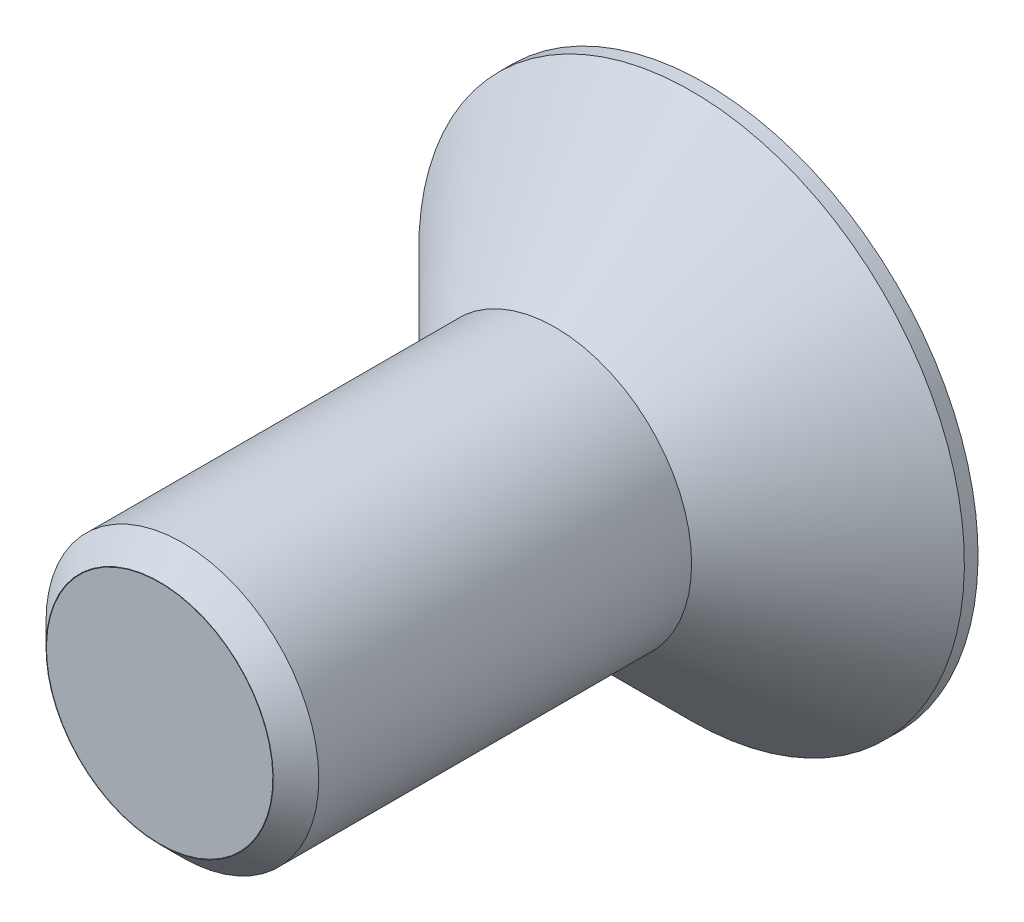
ISO-10303-21;
HEADER;
FILE_DESCRIPTION(('STEP AP214'),'2;1');
FILE_NAME('part.step','',(''),(''),'','','');
FILE_SCHEMA(('AUTOMOTIVE_DESIGN { 1 0 10303 214 1 1 1 1 }'));
ENDSEC;
DATA;
#1=APPLICATION_CONTEXT('core data for automotive mechanical design processes');
#2=APPLICATION_PROTOCOL_DEFINITION('international standard','automotive_design',2000,#1);
#3=PRODUCT_CONTEXT('',#1,'mechanical');
#4=PRODUCT('Part','Part','',(#3));
#5=PRODUCT_RELATED_PRODUCT_CATEGORY('part','',(#4));
#6=PRODUCT_DEFINITION_FORMATION('','',#4);
#7=PRODUCT_DEFINITION_CONTEXT('part definition',#1,'design');
#8=PRODUCT_DEFINITION('design','',#6,#7);
#9=PRODUCT_DEFINITION_SHAPE('','',#8);
#10=(LENGTH_UNIT() NAMED_UNIT(*) SI_UNIT(.MILLI.,.METRE.));
#11=(NAMED_UNIT(*) PLANE_ANGLE_UNIT() SI_UNIT($,.RADIAN.));
#12=(NAMED_UNIT(*) SI_UNIT($,.STERADIAN.) SOLID_ANGLE_UNIT());
#13=UNCERTAINTY_MEASURE_WITH_UNIT(LENGTH_MEASURE(1.E-05),#10,'distance_accuracy_value','');
#14=(GEOMETRIC_REPRESENTATION_CONTEXT(3) GLOBAL_UNCERTAINTY_ASSIGNED_CONTEXT((#13)) GLOBAL_UNIT_ASSIGNED_CONTEXT((#10,
#11,#12)) REPRESENTATION_CONTEXT('',''));
#15=CARTESIAN_POINT('',(0.,0.,0.));
#16=DIRECTION('',(0.,0.,1.));
#17=DIRECTION('',(1.,0.,0.));
#18=AXIS2_PLACEMENT_3D('',#15,#16,#17);
#19=CARTESIAN_POINT('',(0.,0.,0.));
#20=DIRECTION('',(0.,0.,-1.));
#21=DIRECTION('',(0.,1.,0.));
#22=AXIS2_PLACEMENT_3D('',#19,#20,#21);
#23=PLANE('',#22);
#24=DIRECTION('',(-1.,0.,0.));
#25=VECTOR('',#24,1.);
#26=CARTESIAN_POINT('',(1.15470053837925,-1.9999999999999,0.));
#27=LINE('',#26,#25);
#28=CARTESIAN_POINT('',(1.15470053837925,-1.9999999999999,0.));
#29=VERTEX_POINT('',#28);
#30=CARTESIAN_POINT('',(-1.15470053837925,-1.9999999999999,0.));
#31=VERTEX_POINT('',#30);
#32=EDGE_CURVE('E48',#29,#31,#27,.T.);
#33=ORIENTED_EDGE('',*,*,#32,.F.);
#34=DIRECTION('',(-0.5,-0.866025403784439,0.));
#35=VECTOR('',#34,1.);
#36=CARTESIAN_POINT('',(2.30940107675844,0.,0.));
#37=LINE('',#36,#35);
#38=CARTESIAN_POINT('',(2.30940107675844,0.,0.));
#39=VERTEX_POINT('',#38);
#40=EDGE_CURVE('E131',#39,#29,#37,.T.);
#41=ORIENTED_EDGE('',*,*,#40,.F.);
#42=DIRECTION('',(0.5,-0.866025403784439,0.));
#43=VECTOR('',#42,1.);
#44=CARTESIAN_POINT('',(1.15470053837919,2.,0.));
#45=LINE('',#44,#43);
#46=CARTESIAN_POINT('',(1.15470053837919,2.,0.));
#47=VERTEX_POINT('',#46);
#48=EDGE_CURVE('E129',#47,#39,#45,.T.);
#49=ORIENTED_EDGE('',*,*,#48,.F.);
#50=DIRECTION('',(1.,0.,0.));
#51=VECTOR('',#50,1.);
#52=CARTESIAN_POINT('',(-1.15470053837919,2.,0.));
#53=LINE('',#52,#51);
#54=CARTESIAN_POINT('',(-1.15470053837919,2.,0.));
#55=VERTEX_POINT('',#54);
#56=EDGE_CURVE('E96',#55,#47,#53,.T.);
#57=ORIENTED_EDGE('',*,*,#56,.F.);
#58=DIRECTION('',(0.5,0.866025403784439,0.));
#59=VECTOR('',#58,1.);
#60=CARTESIAN_POINT('',(-2.30940107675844,0.,0.));
#61=LINE('',#60,#59);
#62=CARTESIAN_POINT('',(-2.30940107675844,0.,0.));
#63=VERTEX_POINT('',#62);
#64=EDGE_CURVE('E125',#63,#55,#61,.T.);
#65=ORIENTED_EDGE('',*,*,#64,.F.);
#66=DIRECTION('',(-0.5,0.866025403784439,0.));
#67=VECTOR('',#66,1.);
#68=CARTESIAN_POINT('',(-1.15470053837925,-1.9999999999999,0.));
#69=LINE('',#68,#67);
#70=EDGE_CURVE('E122',#31,#63,#69,.T.);
#71=ORIENTED_EDGE('',*,*,#70,.F.);
#72=EDGE_LOOP('',(#33,#41,#49,#57,#65,#71));
#73=FACE_BOUND('',#72,.T.);
#74=CARTESIAN_POINT('',(0.,0.,0.));
#75=DIRECTION('',(0.,0.,1.));
#76=DIRECTION('',(0.,-1.,0.));
#77=AXIS2_PLACEMENT_3D('',#74,#75,#76);
#78=CIRCLE('',#77,6.);
#79=CARTESIAN_POINT('',(0.,-6.,0.));
#80=VERTEX_POINT('',#79);
#81=EDGE_CURVE('E11',#80,#80,#78,.T.);
#82=ORIENTED_EDGE('',*,*,#81,.F.);
#83=EDGE_LOOP('',(#82));
#84=FACE_BOUND('',#83,.T.);
#85=ADVANCED_FACE('F34',(#73,#84),#23,.T.);
#86=CARTESIAN_POINT('',(0.,0.,0.));
#87=DIRECTION('',(0.,0.,1.));
#88=DIRECTION('',(0.,-1.,0.));
#89=AXIS2_PLACEMENT_3D('',#86,#87,#88);
#90=CYLINDRICAL_SURFACE('',#89,5.99999999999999);
#91=ORIENTED_EDGE('',*,*,#81,.T.);
#92=EDGE_LOOP('',(#91));
#93=FACE_BOUND('',#92,.T.);
#94=CARTESIAN_POINT('',(0.,0.,0.300000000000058));
#95=DIRECTION('',(0.,0.,1.));
#96=DIRECTION('',(0.,-1.,0.));
#97=AXIS2_PLACEMENT_3D('',#94,#95,#96);
#98=CIRCLE('',#97,5.99999999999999);
#99=CARTESIAN_POINT('',(0.,-5.99999999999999,0.300000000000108));
#100=VERTEX_POINT('',#99);
#101=EDGE_CURVE('E41',#100,#100,#98,.T.);
#102=ORIENTED_EDGE('',*,*,#101,.F.);
#103=EDGE_LOOP('',(#102));
#104=FACE_BOUND('',#103,.T.);
#105=ADVANCED_FACE('F169',(#93,#104),#90,.T.);
#106=CARTESIAN_POINT('',(0.,0.,3.30000000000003));
#107=DIRECTION('',(0.,0.,-1.));
#108=DIRECTION('',(0.,1.,0.));
#109=AXIS2_PLACEMENT_3D('',#106,#107,#108);
#110=CONICAL_SURFACE('',#109,2.99999999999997,0.785398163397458);
#111=ORIENTED_EDGE('',*,*,#101,.T.);
#112=EDGE_LOOP('',(#111));
#113=FACE_BOUND('',#112,.T.);
#114=CARTESIAN_POINT('',(0.,0.,3.30000000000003));
#115=DIRECTION('',(0.,0.,1.));
#116=DIRECTION('',(0.,-1.,0.));
#117=AXIS2_PLACEMENT_3D('',#114,#115,#116);
#118=CIRCLE('',#117,2.99999999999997);
#119=CARTESIAN_POINT('',(0.,-2.99999999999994,3.30000000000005));
#120=VERTEX_POINT('',#119);
#121=EDGE_CURVE('E161',#120,#120,#118,.T.);
#122=ORIENTED_EDGE('',*,*,#121,.F.);
#123=EDGE_LOOP('',(#122));
#124=FACE_BOUND('',#123,.T.);
#125=ADVANCED_FACE('F166',(#113,#124),#110,.T.);
#126=CARTESIAN_POINT('',(0.,0.,0.));
#127=DIRECTION('',(0.,0.,1.));
#128=DIRECTION('',(0.,-1.,0.));
#129=AXIS2_PLACEMENT_3D('',#126,#127,#128);
#130=CYLINDRICAL_SURFACE('',#129,2.99999999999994);
#131=ORIENTED_EDGE('',*,*,#121,.T.);
#132=EDGE_LOOP('',(#131));
#133=FACE_BOUND('',#132,.T.);
#134=CARTESIAN_POINT('',(0.,0.,11.5));
#135=DIRECTION('',(0.,0.,1.));
#136=DIRECTION('',(0.,-1.,0.));
#137=AXIS2_PLACEMENT_3D('',#134,#135,#136);
#138=CIRCLE('',#137,2.9999999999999);
#139=CARTESIAN_POINT('',(0.,-2.9999999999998,11.5000000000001));
#140=VERTEX_POINT('',#139);
#141=EDGE_CURVE('E158',#140,#140,#138,.T.);
#142=ORIENTED_EDGE('',*,*,#141,.F.);
#143=EDGE_LOOP('',(#142));
#144=FACE_BOUND('',#143,.T.);
#145=ADVANCED_FACE('F176',(#133,#144),#130,.T.);
#146=CARTESIAN_POINT('',(0.,0.,12.));
#147=DIRECTION('',(0.,0.,-1.));
#148=DIRECTION('',(0.,1.,0.));
#149=AXIS2_PLACEMENT_3D('',#146,#147,#148);
#150=CONICAL_SURFACE('',#149,2.4999999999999,0.785398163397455);
#151=ORIENTED_EDGE('',*,*,#141,.T.);
#152=EDGE_LOOP('',(#151));
#153=FACE_BOUND('',#152,.T.);
#154=CARTESIAN_POINT('',(0.,0.,12.));
#155=DIRECTION('',(0.,0.,1.));
#156=DIRECTION('',(0.,-1.,0.));
#157=AXIS2_PLACEMENT_3D('',#154,#155,#156);
#158=CIRCLE('',#157,2.4999999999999);
#159=CARTESIAN_POINT('',(0.,-2.4999999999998,12.));
#160=VERTEX_POINT('',#159);
#161=EDGE_CURVE('E155',#160,#160,#158,.T.);
#162=ORIENTED_EDGE('',*,*,#161,.F.);
#163=EDGE_LOOP('',(#162));
#164=FACE_BOUND('',#163,.T.);
#165=ADVANCED_FACE('F182',(#153,#164),#150,.T.);
#166=CARTESIAN_POINT('',(0.,0.,0.));
#167=DIRECTION('',(0.,0.,1.));
#168=DIRECTION('',(0.,-1.,0.));
#169=AXIS2_PLACEMENT_3D('',#166,#167,#168);
#170=CYLINDRICAL_SURFACE('',#169,2.49999999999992);
#171=ORIENTED_EDGE('',*,*,#161,.T.);
#172=EDGE_LOOP('',(#171));
#173=FACE_BOUND('',#172,.T.);
#174=CARTESIAN_POINT('',(0.,0.,6.49000000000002));
#175=DIRECTION('',(0.,0.,1.));
#176=DIRECTION('',(0.,-1.,0.));
#177=AXIS2_PLACEMENT_3D('',#174,#175,#176);
#178=CIRCLE('',#177,2.49999999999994);
#179=CARTESIAN_POINT('',(0.,-2.49999999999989,6.49000000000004));
#180=VERTEX_POINT('',#179);
#181=EDGE_CURVE('E152',#180,#180,#178,.T.);
#182=ORIENTED_EDGE('',*,*,#181,.F.);
#183=EDGE_LOOP('',(#182));
#184=FACE_BOUND('',#183,.T.);
#185=ADVANCED_FACE('F186',(#173,#184),#170,.F.);
#186=CARTESIAN_POINT('',(0.,0.,6.00000000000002));
#187=DIRECTION('',(0.,0.,-1.));
#188=DIRECTION('',(0.,1.,0.));
#189=AXIS2_PLACEMENT_3D('',#186,#187,#188);
#190=CONICAL_SURFACE('',#189,2.98999999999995,0.785398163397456);
#191=ORIENTED_EDGE('',*,*,#181,.T.);
#192=EDGE_LOOP('',(#191));
#193=FACE_BOUND('',#192,.T.);
#194=CARTESIAN_POINT('',(0.,0.,6.00000000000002));
#195=DIRECTION('',(0.,0.,1.));
#196=DIRECTION('',(0.,-1.,0.));
#197=AXIS2_PLACEMENT_3D('',#194,#195,#196);
#198=CIRCLE('',#197,2.98999999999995);
#199=CARTESIAN_POINT('',(0.,-2.9899999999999,6.00000000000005));
#200=VERTEX_POINT('',#199);
#201=EDGE_CURVE('E149',#200,#200,#198,.T.);
#202=ORIENTED_EDGE('',*,*,#201,.F.);
#203=EDGE_LOOP('',(#202));
#204=FACE_BOUND('',#203,.T.);
#205=ADVANCED_FACE('F190',(#193,#204),#190,.F.);
#206=CARTESIAN_POINT('',(0.,0.,0.));
#207=DIRECTION('',(0.,0.,1.));
#208=DIRECTION('',(0.,-1.,0.));
#209=AXIS2_PLACEMENT_3D('',#206,#207,#208);
#210=CYLINDRICAL_SURFACE('',#209,2.98999999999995);
#211=ORIENTED_EDGE('',*,*,#201,.T.);
#212=EDGE_LOOP('',(#211));
#213=FACE_BOUND('',#212,.T.);
#214=CARTESIAN_POINT('',(0.,0.,5.99000000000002));
#215=DIRECTION('',(0.,0.,1.));
#216=DIRECTION('',(0.,-1.,0.));
#217=AXIS2_PLACEMENT_3D('',#214,#215,#216);
#218=CIRCLE('',#217,2.98999999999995);
#219=CARTESIAN_POINT('',(0.,-2.9899999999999,5.99000000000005));
#220=VERTEX_POINT('',#219);
#221=EDGE_CURVE('E146',#220,#220,#218,.T.);
#222=ORIENTED_EDGE('',*,*,#221,.F.);
#223=EDGE_LOOP('',(#222));
#224=FACE_BOUND('',#223,.T.);
#225=ADVANCED_FACE('F194',(#213,#224),#210,.F.);
#226=CARTESIAN_POINT('',(0.,0.,6.49000000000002));
#227=DIRECTION('',(0.,0.,-1.));
#228=DIRECTION('',(0.,1.,0.));
#229=AXIS2_PLACEMENT_3D('',#226,#227,#228);
#230=CONICAL_SURFACE('',#229,2.48999999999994,0.785398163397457);
#231=ORIENTED_EDGE('',*,*,#221,.T.);
#232=EDGE_LOOP('',(#231));
#233=FACE_BOUND('',#232,.T.);
#234=CARTESIAN_POINT('',(0.,0.,6.49000000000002));
#235=DIRECTION('',(0.,0.,1.));
#236=DIRECTION('',(0.,-1.,0.));
#237=AXIS2_PLACEMENT_3D('',#234,#235,#236);
#238=CIRCLE('',#237,2.48999999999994);
#239=CARTESIAN_POINT('',(0.,-2.48999999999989,6.49000000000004));
#240=VERTEX_POINT('',#239);
#241=EDGE_CURVE('E143',#240,#240,#238,.T.);
#242=ORIENTED_EDGE('',*,*,#241,.F.);
#243=EDGE_LOOP('',(#242));
#244=FACE_BOUND('',#243,.T.);
#245=ADVANCED_FACE('F198',(#233,#244),#230,.T.);
#246=CARTESIAN_POINT('',(0.,0.,0.));
#247=DIRECTION('',(0.,0.,1.));
#248=DIRECTION('',(0.,-1.,0.));
#249=AXIS2_PLACEMENT_3D('',#246,#247,#248);
#250=CYLINDRICAL_SURFACE('',#249,2.48999999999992);
#251=ORIENTED_EDGE('',*,*,#241,.T.);
#252=EDGE_LOOP('',(#251));
#253=FACE_BOUND('',#252,.T.);
#254=CARTESIAN_POINT('',(0.,0.,12.));
#255=DIRECTION('',(0.,0.,1.));
#256=DIRECTION('',(0.,-1.,0.));
#257=AXIS2_PLACEMENT_3D('',#254,#255,#256);
#258=CIRCLE('',#257,2.4899999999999);
#259=CARTESIAN_POINT('',(0.,-2.4899999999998,12.));
#260=VERTEX_POINT('',#259);
#261=EDGE_CURVE('E135',#260,#260,#258,.T.);
#262=ORIENTED_EDGE('',*,*,#261,.F.);
#263=EDGE_LOOP('',(#262));
#264=FACE_BOUND('',#263,.T.);
#265=ADVANCED_FACE('F202',(#253,#264),#250,.T.);
#266=CARTESIAN_POINT('',(0.,2.49,12.));
#267=DIRECTION('',(0.,0.,1.));
#268=DIRECTION('',(0.,-1.,0.));
#269=AXIS2_PLACEMENT_3D('',#266,#267,#268);
#270=PLANE('',#269);
#271=ORIENTED_EDGE('',*,*,#261,.T.);
#272=EDGE_LOOP('',(#271));
#273=FACE_BOUND('',#272,.T.);
#274=ADVANCED_FACE('F206',(#273),#270,.T.);
#275=CARTESIAN_POINT('',(1.15470053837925,-1.9999999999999,2.5));
#276=DIRECTION('',(0.,-1.,0.));
#277=DIRECTION('',(0.,0.,-1.));
#278=AXIS2_PLACEMENT_3D('',#275,#276,#277);
#279=PLANE('',#278);
#280=ORIENTED_EDGE('',*,*,#32,.T.);
#281=DIRECTION('',(0.,0.,-1.));
#282=VECTOR('',#281,1.);
#283=CARTESIAN_POINT('',(-1.15470053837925,-1.9999999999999,2.5));
#284=LINE('',#283,#282);
#285=CARTESIAN_POINT('',(-1.15470053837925,-1.9999999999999,2.5));
#286=VERTEX_POINT('',#285);
#287=EDGE_CURVE('E78',#286,#31,#284,.T.);
#288=ORIENTED_EDGE('',*,*,#287,.F.);
#289=DIRECTION('',(-1.,0.,0.));
#290=VECTOR('',#289,1.);
#291=CARTESIAN_POINT('',(1.15470053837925,-1.9999999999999,2.5));
#292=LINE('',#291,#290);
#293=CARTESIAN_POINT('',(1.15470053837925,-1.9999999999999,2.5));
#294=VERTEX_POINT('',#293);
#295=EDGE_CURVE('E133',#294,#286,#292,.T.);
#296=ORIENTED_EDGE('',*,*,#295,.F.);
#297=DIRECTION('',(0.,0.,-1.));
#298=VECTOR('',#297,1.);
#299=CARTESIAN_POINT('',(1.15470053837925,-1.9999999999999,2.5));
#300=LINE('',#299,#298);
#301=EDGE_CURVE('E56',#294,#29,#300,.T.);
#302=ORIENTED_EDGE('',*,*,#301,.T.);
#303=EDGE_LOOP('',(#280,#288,#296,#302));
#304=FACE_BOUND('',#303,.T.);
#305=ADVANCED_FACE('F210',(#304),#279,.F.);
#306=CARTESIAN_POINT('',(2.30940107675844,0.,2.5));
#307=DIRECTION('',(0.866025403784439,-0.499999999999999,0.));
#308=DIRECTION('',(0.5,0.866025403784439,0.));
#309=AXIS2_PLACEMENT_3D('',#306,#307,#308);
#310=PLANE('',#309);
#311=ORIENTED_EDGE('',*,*,#40,.T.);
#312=ORIENTED_EDGE('',*,*,#301,.F.);
#313=DIRECTION('',(-0.5,-0.866025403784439,0.));
#314=VECTOR('',#313,1.);
#315=CARTESIAN_POINT('',(2.30940107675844,0.,2.5));
#316=LINE('',#315,#314);
#317=CARTESIAN_POINT('',(2.30940107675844,0.,2.5));
#318=VERTEX_POINT('',#317);
#319=EDGE_CURVE('E108',#318,#294,#316,.T.);
#320=ORIENTED_EDGE('',*,*,#319,.F.);
#321=DIRECTION('',(0.,0.,-1.));
#322=VECTOR('',#321,1.);
#323=CARTESIAN_POINT('',(2.30940107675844,0.,2.5));
#324=LINE('',#323,#322);
#325=EDGE_CURVE('E100',#318,#39,#324,.T.);
#326=ORIENTED_EDGE('',*,*,#325,.T.);
#327=EDGE_LOOP('',(#311,#312,#320,#326));
#328=FACE_BOUND('',#327,.T.);
#329=ADVANCED_FACE('F214',(#328),#310,.F.);
#330=CARTESIAN_POINT('',(1.15470053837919,2.,2.5));
#331=DIRECTION('',(0.866025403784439,0.5,0.));
#332=DIRECTION('',(-0.5,0.866025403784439,0.));
#333=AXIS2_PLACEMENT_3D('',#330,#331,#332);
#334=PLANE('',#333);
#335=ORIENTED_EDGE('',*,*,#48,.T.);
#336=ORIENTED_EDGE('',*,*,#325,.F.);
#337=DIRECTION('',(0.5,-0.866025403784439,0.));
#338=VECTOR('',#337,1.);
#339=CARTESIAN_POINT('',(1.15470053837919,2.,2.5));
#340=LINE('',#339,#338);
#341=CARTESIAN_POINT('',(1.15470053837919,2.,2.5));
#342=VERTEX_POINT('',#341);
#343=EDGE_CURVE('E104',#342,#318,#340,.T.);
#344=ORIENTED_EDGE('',*,*,#343,.F.);
#345=DIRECTION('',(0.,0.,-1.));
#346=VECTOR('',#345,1.);
#347=CARTESIAN_POINT('',(1.15470053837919,2.,2.5));
#348=LINE('',#347,#346);
#349=EDGE_CURVE('E89',#342,#47,#348,.T.);
#350=ORIENTED_EDGE('',*,*,#349,.T.);
#351=EDGE_LOOP('',(#335,#336,#344,#350));
#352=FACE_BOUND('',#351,.T.);
#353=ADVANCED_FACE('F105',(#352),#334,.F.);
#354=CARTESIAN_POINT('',(-1.15470053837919,2.,2.5));
#355=DIRECTION('',(0.,1.,0.));
#356=DIRECTION('',(0.,0.,1.));
#357=AXIS2_PLACEMENT_3D('',#354,#355,#356);
#358=PLANE('',#357);
#359=ORIENTED_EDGE('',*,*,#56,.T.);
#360=ORIENTED_EDGE('',*,*,#349,.F.);
#361=DIRECTION('',(1.,0.,0.));
#362=VECTOR('',#361,1.);
#363=CARTESIAN_POINT('',(-1.15470053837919,2.,2.5));
#364=LINE('',#363,#362);
#365=CARTESIAN_POINT('',(-1.15470053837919,2.,2.5));
#366=VERTEX_POINT('',#365);
#367=EDGE_CURVE('E93',#366,#342,#364,.T.);
#368=ORIENTED_EDGE('',*,*,#367,.F.);
#369=DIRECTION('',(0.,0.,-1.));
#370=VECTOR('',#369,1.);
#371=CARTESIAN_POINT('',(-1.15470053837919,2.,2.5));
#372=LINE('',#371,#370);
#373=EDGE_CURVE('E101',#366,#55,#372,.T.);
#374=ORIENTED_EDGE('',*,*,#373,.T.);
#375=EDGE_LOOP('',(#359,#360,#368,#374));
#376=FACE_BOUND('',#375,.T.);
#377=ADVANCED_FACE('F91',(#376),#358,.F.);
#378=CARTESIAN_POINT('',(-2.30940107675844,0.,2.5));
#379=DIRECTION('',(-0.866025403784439,0.5,0.));
#380=DIRECTION('',(-0.5,-0.866025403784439,0.));
#381=AXIS2_PLACEMENT_3D('',#378,#379,#380);
#382=PLANE('',#381);
#383=ORIENTED_EDGE('',*,*,#64,.T.);
#384=ORIENTED_EDGE('',*,*,#373,.F.);
#385=DIRECTION('',(0.5,0.866025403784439,0.));
#386=VECTOR('',#385,1.);
#387=CARTESIAN_POINT('',(-2.30940107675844,0.,2.5));
#388=LINE('',#387,#386);
#389=CARTESIAN_POINT('',(-2.30940107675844,0.,2.5));
#390=VERTEX_POINT('',#389);
#391=EDGE_CURVE('E114',#390,#366,#388,.T.);
#392=ORIENTED_EDGE('',*,*,#391,.F.);
#393=DIRECTION('',(0.,0.,-1.));
#394=VECTOR('',#393,1.);
#395=CARTESIAN_POINT('',(-2.30940107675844,0.,2.5));
#396=LINE('',#395,#394);
#397=EDGE_CURVE('E138',#390,#63,#396,.T.);
#398=ORIENTED_EDGE('',*,*,#397,.T.);
#399=EDGE_LOOP('',(#383,#384,#392,#398));
#400=FACE_BOUND('',#399,.T.);
#401=ADVANCED_FACE('F218',(#400),#382,.F.);
#402=CARTESIAN_POINT('',(-1.15470053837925,-1.9999999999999,2.5));
#403=DIRECTION('',(-0.866025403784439,-0.499999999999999,0.));
#404=DIRECTION('',(0.5,-0.866025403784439,0.));
#405=AXIS2_PLACEMENT_3D('',#402,#403,#404);
#406=PLANE('',#405);
#407=ORIENTED_EDGE('',*,*,#70,.T.);
#408=ORIENTED_EDGE('',*,*,#397,.F.);
#409=DIRECTION('',(-0.5,0.866025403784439,0.));
#410=VECTOR('',#409,1.);
#411=CARTESIAN_POINT('',(-1.15470053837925,-1.9999999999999,2.5));
#412=LINE('',#411,#410);
#413=EDGE_CURVE('E116',#286,#390,#412,.T.);
#414=ORIENTED_EDGE('',*,*,#413,.F.);
#415=ORIENTED_EDGE('',*,*,#287,.T.);
#416=EDGE_LOOP('',(#407,#408,#414,#415));
#417=FACE_BOUND('',#416,.T.);
#418=ADVANCED_FACE('F215',(#417),#406,.F.);
#419=CARTESIAN_POINT('',(0.,0.,2.5));
#420=DIRECTION('',(0.,0.,-1.));
#421=DIRECTION('',(0.,1.,0.));
#422=AXIS2_PLACEMENT_3D('',#419,#420,#421);
#423=PLANE('',#422);
#424=ORIENTED_EDGE('',*,*,#295,.T.);
#425=ORIENTED_EDGE('',*,*,#413,.T.);
#426=ORIENTED_EDGE('',*,*,#391,.T.);
#427=ORIENTED_EDGE('',*,*,#367,.T.);
#428=ORIENTED_EDGE('',*,*,#343,.T.);
#429=ORIENTED_EDGE('',*,*,#319,.T.);
#430=EDGE_LOOP('',(#424,#425,#426,#427,#428,#429));
#431=FACE_BOUND('',#430,.T.);
#432=ADVANCED_FACE('F111',(#431),#423,.T.);
#433=CLOSED_SHELL('',(#85,#105,#125,#145,#165,#185,#205,#225,#245,#265,#274,#305,#329,#353,#377,
#401,#418,#432));
#434=MANIFOLD_SOLID_BREP('B2',#433);
#435=ADVANCED_BREP_SHAPE_REPRESENTATION('',(#18,#434),#14);
#436=SHAPE_DEFINITION_REPRESENTATION(#9,#435);
ENDSEC;
END-ISO-10303-21;
